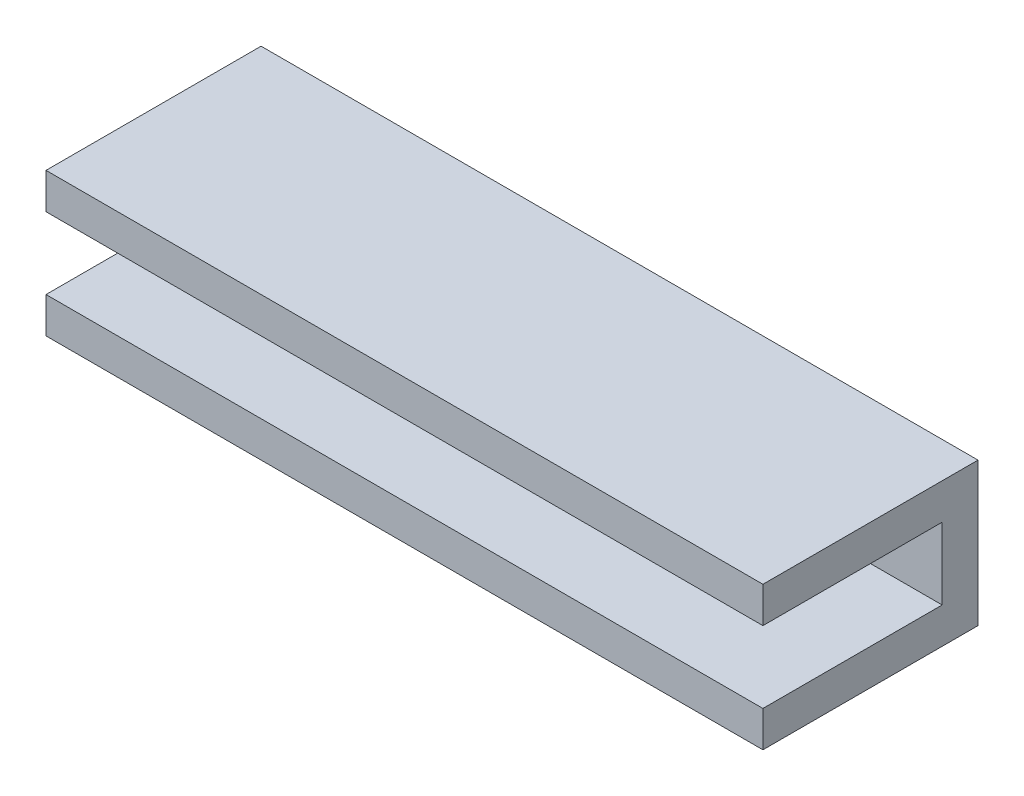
from build123d import *

# Parameters (mm, degrees)
SKETCH2_W           = 100
SKETCH2_H           = 20
BOSS_EXTRUDE1_DEPTH = 30
SKETCH3_W           = 25
SKETCH3_H           = 10
CUT_EXTRUDE2_DEPTH  = 107.301458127
SKETCH4_R           = 2
CUT_EXTRUDE3_DEPTH  = 106


with BuildPart() as part:
    # Sketch2 → Boss-Extrude1 (new body)
    with BuildSketch(Plane.XY):
        with Locations((50, 10)):
            Rectangle(SKETCH2_W, SKETCH2_H)
    extrude(amount=BOSS_EXTRUDE1_DEPTH)

    # Sketch3 → Cut-Extrude2 (cut, through all)
    with BuildSketch(Plane(origin=(100, 0, 0), x_dir=(0, 0, -1), z_dir=(1, 0, 0))):
        with Locations((-17.5, 10)):
            Rectangle(SKETCH3_W, SKETCH3_H)
    extrude(amount=-CUT_EXTRUDE2_DEPTH, mode=Mode.SUBTRACT)

    # Sketch4 → Cut-Extrude3 (cut, through all)
    with BuildSketch(Plane.XY.offset(5)):
        with Locations((50, 10)):
            Circle(SKETCH4_R)
    extrude(amount=-CUT_EXTRUDE3_DEPTH, mode=Mode.SUBTRACT)


solid = part.part
